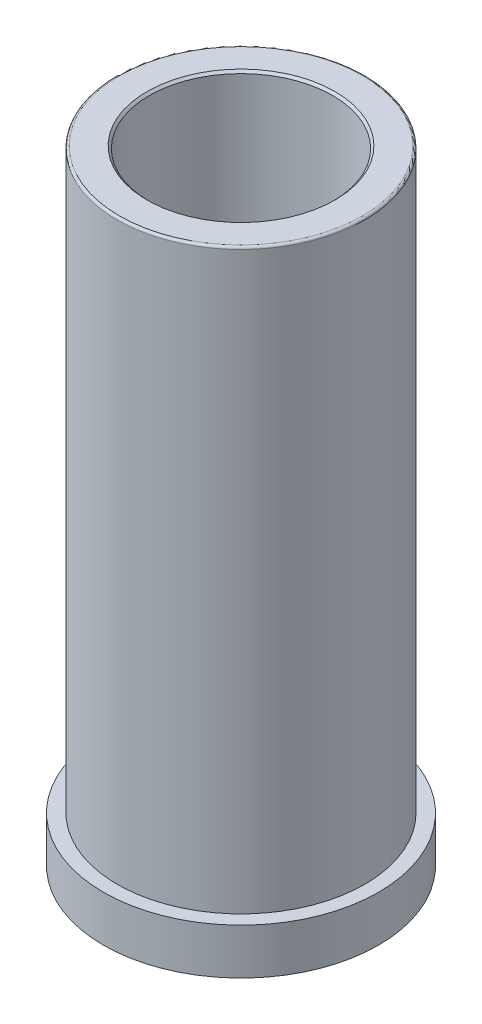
ISO-10303-21;
HEADER;
FILE_DESCRIPTION(('STEP AP214'),'2;1');
FILE_NAME('part.step','',(''),(''),'','','');
FILE_SCHEMA(('AUTOMOTIVE_DESIGN { 1 0 10303 214 1 1 1 1 }'));
ENDSEC;
DATA;
#1=APPLICATION_CONTEXT('core data for automotive mechanical design processes');
#2=APPLICATION_PROTOCOL_DEFINITION('international standard','automotive_design',2000,#1);
#3=PRODUCT_CONTEXT('',#1,'mechanical');
#4=PRODUCT('Part','Part','',(#3));
#5=PRODUCT_RELATED_PRODUCT_CATEGORY('part','',(#4));
#6=PRODUCT_DEFINITION_FORMATION('','',#4);
#7=PRODUCT_DEFINITION_CONTEXT('part definition',#1,'design');
#8=PRODUCT_DEFINITION('design','',#6,#7);
#9=PRODUCT_DEFINITION_SHAPE('','',#8);
#10=(LENGTH_UNIT() NAMED_UNIT(*) SI_UNIT(.MILLI.,.METRE.));
#11=(NAMED_UNIT(*) PLANE_ANGLE_UNIT() SI_UNIT($,.RADIAN.));
#12=(NAMED_UNIT(*) SI_UNIT($,.STERADIAN.) SOLID_ANGLE_UNIT());
#13=UNCERTAINTY_MEASURE_WITH_UNIT(LENGTH_MEASURE(1.E-05),#10,'distance_accuracy_value','');
#14=(GEOMETRIC_REPRESENTATION_CONTEXT(3) GLOBAL_UNCERTAINTY_ASSIGNED_CONTEXT((#13)) GLOBAL_UNIT_ASSIGNED_CONTEXT((#10,
#11,#12)) REPRESENTATION_CONTEXT('',''));
#15=CARTESIAN_POINT('',(0.,0.,0.));
#16=DIRECTION('',(0.,0.,1.));
#17=DIRECTION('',(1.,0.,0.));
#18=AXIS2_PLACEMENT_3D('',#15,#16,#17);
#19=CARTESIAN_POINT('',(0.,0.,0.));
#20=DIRECTION('',(0.,-1.,0.));
#21=DIRECTION('',(0.,0.,-1.));
#22=AXIS2_PLACEMENT_3D('',#19,#20,#21);
#23=CYLINDRICAL_SURFACE('',#22,27.);
#24=CARTESIAN_POINT('',(0.,125.5,0.));
#25=DIRECTION('',(0.,-1.,0.));
#26=DIRECTION('',(0.,0.,-1.));
#27=AXIS2_PLACEMENT_3D('',#24,#25,#26);
#28=CIRCLE('',#27,27.);
#29=CARTESIAN_POINT('',(0.,125.5,-27.));
#30=VERTEX_POINT('',#29);
#31=EDGE_CURVE('E21',#30,#30,#28,.T.);
#32=ORIENTED_EDGE('',*,*,#31,.T.);
#33=EDGE_LOOP('',(#32));
#34=FACE_BOUND('',#33,.T.);
#35=CARTESIAN_POINT('',(0.,0.,0.));
#36=DIRECTION('',(0.,-1.,0.));
#37=DIRECTION('',(0.,0.,-1.));
#38=AXIS2_PLACEMENT_3D('',#35,#36,#37);
#39=CIRCLE('',#38,27.);
#40=CARTESIAN_POINT('',(0.,0.,-27.));
#41=VERTEX_POINT('',#40);
#42=EDGE_CURVE('E52',#41,#41,#39,.T.);
#43=ORIENTED_EDGE('',*,*,#42,.F.);
#44=EDGE_LOOP('',(#43));
#45=FACE_BOUND('',#44,.T.);
#46=ADVANCED_FACE('F14',(#34,#45),#23,.T.);
#47=CARTESIAN_POINT('',(-27.,126.,0.));
#48=DIRECTION('',(0.,-1.,0.));
#49=DIRECTION('',(0.,0.,-1.));
#50=AXIS2_PLACEMENT_3D('',#47,#48,#49);
#51=PLANE('',#50);
#52=CARTESIAN_POINT('',(0.,126.,0.));
#53=DIRECTION('',(0.,-1.,0.));
#54=DIRECTION('',(0.,0.,-1.));
#55=AXIS2_PLACEMENT_3D('',#52,#53,#54);
#56=CIRCLE('',#55,26.5);
#57=CARTESIAN_POINT('',(0.,126.,-26.5));
#58=VERTEX_POINT('',#57);
#59=EDGE_CURVE('E9',#58,#58,#56,.F.);
#60=ORIENTED_EDGE('',*,*,#59,.T.);
#61=EDGE_LOOP('',(#60));
#62=FACE_BOUND('',#61,.T.);
#63=CARTESIAN_POINT('',(0.,126.,0.));
#64=DIRECTION('',(0.,-1.,0.));
#65=DIRECTION('',(0.,0.,-1.));
#66=AXIS2_PLACEMENT_3D('',#63,#64,#65);
#67=CIRCLE('',#66,20.5);
#68=CARTESIAN_POINT('',(0.,126.,-20.5));
#69=VERTEX_POINT('',#68);
#70=EDGE_CURVE('E37',#69,#69,#67,.T.);
#71=ORIENTED_EDGE('',*,*,#70,.T.);
#72=EDGE_LOOP('',(#71));
#73=FACE_BOUND('',#72,.T.);
#74=ADVANCED_FACE('F59',(#62,#73),#51,.F.);
#75=CARTESIAN_POINT('',(0.,0.,0.));
#76=DIRECTION('',(0.,-1.,0.));
#77=DIRECTION('',(0.,0.,-1.));
#78=AXIS2_PLACEMENT_3D('',#75,#76,#77);
#79=CYLINDRICAL_SURFACE('',#78,20.);
#80=CARTESIAN_POINT('',(0.,125.5,0.));
#81=DIRECTION('',(0.,-1.,0.));
#82=DIRECTION('',(0.,0.,-1.));
#83=AXIS2_PLACEMENT_3D('',#80,#81,#82);
#84=CIRCLE('',#83,20.);
#85=CARTESIAN_POINT('',(0.,125.5,-20.));
#86=VERTEX_POINT('',#85);
#87=EDGE_CURVE('E34',#86,#86,#84,.F.);
#88=ORIENTED_EDGE('',*,*,#87,.T.);
#89=EDGE_LOOP('',(#88));
#90=FACE_BOUND('',#89,.T.);
#91=CARTESIAN_POINT('',(0.,10.,0.));
#92=DIRECTION('',(0.,-1.,0.));
#93=DIRECTION('',(0.,0.,-1.));
#94=AXIS2_PLACEMENT_3D('',#91,#92,#93);
#95=CIRCLE('',#94,20.);
#96=CARTESIAN_POINT('',(0.,10.,-20.));
#97=VERTEX_POINT('',#96);
#98=EDGE_CURVE('E40',#97,#97,#95,.T.);
#99=ORIENTED_EDGE('',*,*,#98,.T.);
#100=EDGE_LOOP('',(#99));
#101=FACE_BOUND('',#100,.T.);
#102=ADVANCED_FACE('F66',(#90,#101),#79,.F.);
#103=CARTESIAN_POINT('',(0.,9.85,0.));
#104=DIRECTION('',(0.,-1.,0.));
#105=DIRECTION('',(0.,0.,-1.));
#106=AXIS2_PLACEMENT_3D('',#103,#104,#105);
#107=CONICAL_SURFACE('',#106,20.1,0.588002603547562);
#108=ORIENTED_EDGE('',*,*,#98,.F.);
#109=EDGE_LOOP('',(#108));
#110=FACE_BOUND('',#109,.T.);
#111=CARTESIAN_POINT('',(0.,9.85,0.));
#112=DIRECTION('',(0.,-1.,0.));
#113=DIRECTION('',(0.,0.,-1.));
#114=AXIS2_PLACEMENT_3D('',#111,#112,#113);
#115=CIRCLE('',#114,20.1);
#116=CARTESIAN_POINT('',(0.,9.85,-20.1));
#117=VERTEX_POINT('',#116);
#118=EDGE_CURVE('E43',#117,#117,#115,.T.);
#119=ORIENTED_EDGE('',*,*,#118,.T.);
#120=EDGE_LOOP('',(#119));
#121=FACE_BOUND('',#120,.T.);
#122=ADVANCED_FACE('F89',(#110,#121),#107,.F.);
#123=CARTESIAN_POINT('',(0.,0.,0.));
#124=DIRECTION('',(0.,-1.,0.));
#125=DIRECTION('',(0.,0.,-1.));
#126=AXIS2_PLACEMENT_3D('',#123,#124,#125);
#127=CYLINDRICAL_SURFACE('',#126,20.1);
#128=CARTESIAN_POINT('',(0.,-9.5,0.));
#129=DIRECTION('',(0.,1.,0.));
#130=DIRECTION('',(0.,0.,1.));
#131=AXIS2_PLACEMENT_3D('',#128,#129,#130);
#132=CIRCLE('',#131,20.1);
#133=CARTESIAN_POINT('',(0.,-9.5,20.1));
#134=VERTEX_POINT('',#133);
#135=EDGE_CURVE('E29',#134,#134,#132,.F.);
#136=ORIENTED_EDGE('',*,*,#135,.T.);
#137=EDGE_LOOP('',(#136));
#138=FACE_BOUND('',#137,.T.);
#139=ORIENTED_EDGE('',*,*,#118,.F.);
#140=EDGE_LOOP('',(#139));
#141=FACE_BOUND('',#140,.T.);
#142=ADVANCED_FACE('F85',(#138,#141),#127,.F.);
#143=CARTESIAN_POINT('',(-20.1,-10.,0.));
#144=DIRECTION('',(0.,1.,0.));
#145=DIRECTION('',(0.,0.,1.));
#146=AXIS2_PLACEMENT_3D('',#143,#144,#145);
#147=PLANE('',#146);
#148=CARTESIAN_POINT('',(0.,-10.,0.));
#149=DIRECTION('',(0.,1.,0.));
#150=DIRECTION('',(0.,0.,1.));
#151=AXIS2_PLACEMENT_3D('',#148,#149,#150);
#152=CIRCLE('',#151,20.6);
#153=CARTESIAN_POINT('',(0.,-10.,20.6));
#154=VERTEX_POINT('',#153);
#155=EDGE_CURVE('E25',#154,#154,#152,.T.);
#156=ORIENTED_EDGE('',*,*,#155,.T.);
#157=EDGE_LOOP('',(#156));
#158=FACE_BOUND('',#157,.T.);
#159=CARTESIAN_POINT('',(0.,-10.,0.));
#160=DIRECTION('',(0.,-1.,0.));
#161=DIRECTION('',(0.,0.,-1.));
#162=AXIS2_PLACEMENT_3D('',#159,#160,#161);
#163=CIRCLE('',#162,30.);
#164=CARTESIAN_POINT('',(0.,-10.,-30.));
#165=VERTEX_POINT('',#164);
#166=EDGE_CURVE('E46',#165,#165,#163,.T.);
#167=ORIENTED_EDGE('',*,*,#166,.T.);
#168=EDGE_LOOP('',(#167));
#169=FACE_BOUND('',#168,.T.);
#170=ADVANCED_FACE('F88',(#158,#169),#147,.F.);
#171=CARTESIAN_POINT('',(0.,0.,0.));
#172=DIRECTION('',(0.,-1.,0.));
#173=DIRECTION('',(0.,0.,-1.));
#174=AXIS2_PLACEMENT_3D('',#171,#172,#173);
#175=CYLINDRICAL_SURFACE('',#174,30.);
#176=ORIENTED_EDGE('',*,*,#166,.F.);
#177=EDGE_LOOP('',(#176));
#178=FACE_BOUND('',#177,.T.);
#179=CARTESIAN_POINT('',(0.,0.,0.));
#180=DIRECTION('',(0.,-1.,0.));
#181=DIRECTION('',(0.,0.,-1.));
#182=AXIS2_PLACEMENT_3D('',#179,#180,#181);
#183=CIRCLE('',#182,30.);
#184=CARTESIAN_POINT('',(0.,0.,-30.));
#185=VERTEX_POINT('',#184);
#186=EDGE_CURVE('E49',#185,#185,#183,.T.);
#187=ORIENTED_EDGE('',*,*,#186,.T.);
#188=EDGE_LOOP('',(#187));
#189=FACE_BOUND('',#188,.T.);
#190=ADVANCED_FACE('F105',(#178,#189),#175,.T.);
#191=CARTESIAN_POINT('',(-30.,0.,0.));
#192=DIRECTION('',(0.,-1.,0.));
#193=DIRECTION('',(0.,0.,-1.));
#194=AXIS2_PLACEMENT_3D('',#191,#192,#193);
#195=PLANE('',#194);
#196=ORIENTED_EDGE('',*,*,#186,.F.);
#197=EDGE_LOOP('',(#196));
#198=FACE_BOUND('',#197,.T.);
#199=ORIENTED_EDGE('',*,*,#42,.T.);
#200=EDGE_LOOP('',(#199));
#201=FACE_BOUND('',#200,.T.);
#202=ADVANCED_FACE('F56',(#198,#201),#195,.F.);
#203=CARTESIAN_POINT('',(0.,126.,0.));
#204=DIRECTION('',(0.,1.,0.));
#205=DIRECTION('',(0.,0.,1.));
#206=AXIS2_PLACEMENT_3D('',#203,#204,#205);
#207=CONICAL_SURFACE('',#206,20.5,0.785398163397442);
#208=ORIENTED_EDGE('',*,*,#87,.F.);
#209=EDGE_LOOP('',(#208));
#210=FACE_BOUND('',#209,.T.);
#211=ORIENTED_EDGE('',*,*,#70,.F.);
#212=EDGE_LOOP('',(#211));
#213=FACE_BOUND('',#212,.T.);
#214=ADVANCED_FACE('F70',(#210,#213),#207,.F.);
#215=CARTESIAN_POINT('',(0.,-9.5,0.));
#216=DIRECTION('',(0.,-1.,0.));
#217=DIRECTION('',(0.,0.,-1.));
#218=AXIS2_PLACEMENT_3D('',#215,#216,#217);
#219=CONICAL_SURFACE('',#218,20.1,0.785398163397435);
#220=ORIENTED_EDGE('',*,*,#155,.F.);
#221=EDGE_LOOP('',(#220));
#222=FACE_BOUND('',#221,.T.);
#223=ORIENTED_EDGE('',*,*,#135,.F.);
#224=EDGE_LOOP('',(#223));
#225=FACE_BOUND('',#224,.T.);
#226=ADVANCED_FACE('F72',(#222,#225),#219,.F.);
#227=CARTESIAN_POINT('',(0.,125.5,0.));
#228=DIRECTION('',(0.,-1.,0.));
#229=DIRECTION('',(0.,0.,-1.));
#230=AXIS2_PLACEMENT_3D('',#227,#228,#229);
#231=TOROIDAL_SURFACE('',#230,26.5,0.5);
#232=ORIENTED_EDGE('',*,*,#59,.F.);
#233=EDGE_LOOP('',(#232));
#234=FACE_BOUND('',#233,.T.);
#235=ORIENTED_EDGE('',*,*,#31,.F.);
#236=EDGE_LOOP('',(#235));
#237=FACE_BOUND('',#236,.T.);
#238=ADVANCED_FACE('F16',(#234,#237),#231,.T.);
#239=CLOSED_SHELL('',(#46,#74,#102,#122,#142,#170,#190,#202,#214,#226,#238));
#240=MANIFOLD_SOLID_BREP('B1',#239);
#241=ADVANCED_BREP_SHAPE_REPRESENTATION('',(#18,#240),#14);
#242=SHAPE_DEFINITION_REPRESENTATION(#9,#241);
ENDSEC;
END-ISO-10303-21;
